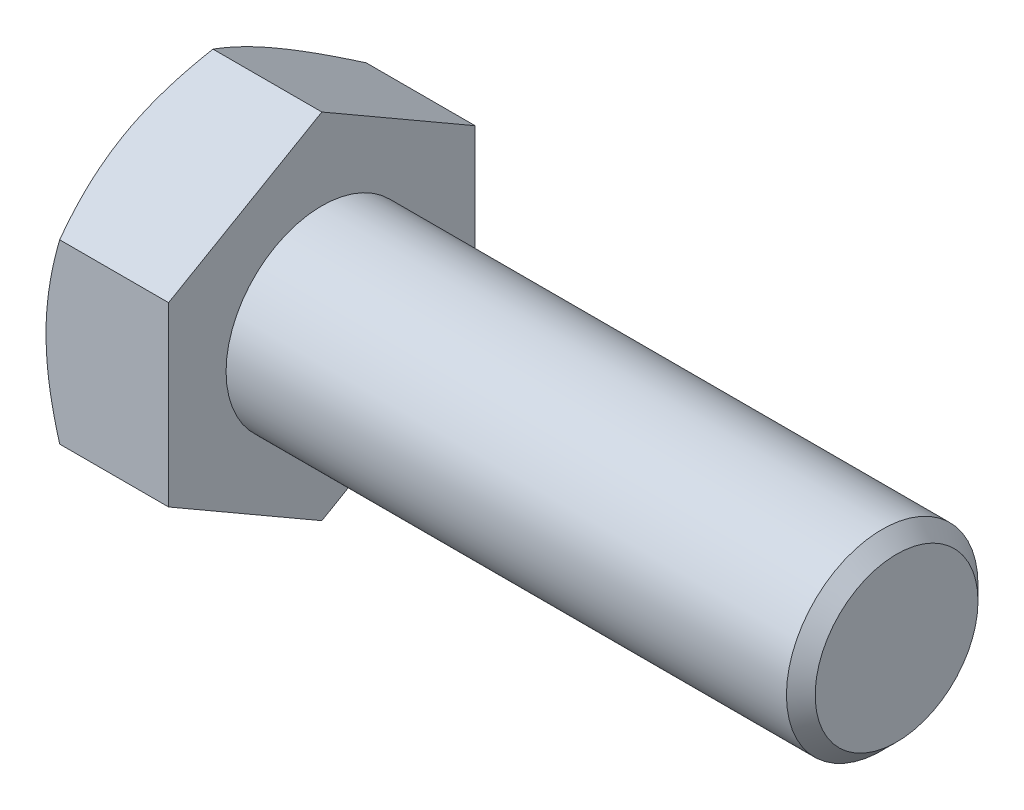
ISO-10303-21;
HEADER;
FILE_DESCRIPTION(('STEP AP214'),'2;1');
FILE_NAME('part.step','',(''),(''),'','','');
FILE_SCHEMA(('AUTOMOTIVE_DESIGN { 1 0 10303 214 1 1 1 1 }'));
ENDSEC;
DATA;
#1=APPLICATION_CONTEXT('core data for automotive mechanical design processes');
#2=APPLICATION_PROTOCOL_DEFINITION('international standard','automotive_design',2000,#1);
#3=PRODUCT_CONTEXT('',#1,'mechanical');
#4=PRODUCT('Part','Part','',(#3));
#5=PRODUCT_RELATED_PRODUCT_CATEGORY('part','',(#4));
#6=PRODUCT_DEFINITION_FORMATION('','',#4);
#7=PRODUCT_DEFINITION_CONTEXT('part definition',#1,'design');
#8=PRODUCT_DEFINITION('design','',#6,#7);
#9=PRODUCT_DEFINITION_SHAPE('','',#8);
#10=(LENGTH_UNIT() NAMED_UNIT(*) SI_UNIT(.MILLI.,.METRE.));
#11=(NAMED_UNIT(*) PLANE_ANGLE_UNIT() SI_UNIT($,.RADIAN.));
#12=(NAMED_UNIT(*) SI_UNIT($,.STERADIAN.) SOLID_ANGLE_UNIT());
#13=UNCERTAINTY_MEASURE_WITH_UNIT(LENGTH_MEASURE(1.E-05),#10,'distance_accuracy_value','');
#14=(GEOMETRIC_REPRESENTATION_CONTEXT(3) GLOBAL_UNCERTAINTY_ASSIGNED_CONTEXT((#13)) GLOBAL_UNIT_ASSIGNED_CONTEXT((#10,
#11,#12)) REPRESENTATION_CONTEXT('',''));
#15=CARTESIAN_POINT('',(0.,0.,0.));
#16=DIRECTION('',(0.,0.,1.));
#17=DIRECTION('',(1.,0.,0.));
#18=AXIS2_PLACEMENT_3D('',#15,#16,#17);
#19=CARTESIAN_POINT('',(30.,0.,0.));
#20=DIRECTION('',(-1.,0.,0.));
#21=DIRECTION('',(0.,0.,1.));
#22=AXIS2_PLACEMENT_3D('',#19,#20,#21);
#23=CYLINDRICAL_SURFACE('',#22,5.);
#24=CARTESIAN_POINT('',(29.25,0.,0.));
#25=DIRECTION('',(1.,0.,0.));
#26=DIRECTION('',(0.,0.,-1.));
#27=AXIS2_PLACEMENT_3D('',#24,#25,#26);
#28=CIRCLE('',#27,5.);
#29=CARTESIAN_POINT('',(29.25,0.,-5.));
#30=VERTEX_POINT('',#29);
#31=EDGE_CURVE('E11',#30,#30,#28,.F.);
#32=ORIENTED_EDGE('',*,*,#31,.T.);
#33=EDGE_LOOP('',(#32));
#34=FACE_BOUND('',#33,.T.);
#35=CARTESIAN_POINT('',(0.,0.,0.));
#36=DIRECTION('',(-1.,0.,0.));
#37=DIRECTION('',(0.,0.,1.));
#38=AXIS2_PLACEMENT_3D('',#35,#36,#37);
#39=CIRCLE('',#38,5.);
#40=CARTESIAN_POINT('',(0.,0.,5.));
#41=VERTEX_POINT('',#40);
#42=EDGE_CURVE('E202',#41,#41,#39,.T.);
#43=ORIENTED_EDGE('',*,*,#42,.F.);
#44=EDGE_LOOP('',(#43));
#45=FACE_BOUND('',#44,.T.);
#46=ADVANCED_FACE('F28',(#34,#45),#23,.T.);
#47=CARTESIAN_POINT('',(30.,0.,0.));
#48=DIRECTION('',(1.,0.,0.));
#49=DIRECTION('',(0.,0.,-1.));
#50=AXIS2_PLACEMENT_3D('',#47,#48,#49);
#51=PLANE('',#50);
#52=CARTESIAN_POINT('',(30.,0.,0.));
#53=DIRECTION('',(1.,0.,0.));
#54=DIRECTION('',(0.,0.,-1.));
#55=AXIS2_PLACEMENT_3D('',#52,#53,#54);
#56=CIRCLE('',#55,4.24999999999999);
#57=CARTESIAN_POINT('',(30.,0.,-4.24999999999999));
#58=VERTEX_POINT('',#57);
#59=EDGE_CURVE('E35',#58,#58,#56,.T.);
#60=ORIENTED_EDGE('',*,*,#59,.T.);
#61=EDGE_LOOP('',(#60));
#62=FACE_BOUND('',#61,.T.);
#63=ADVANCED_FACE('F188',(#62),#51,.T.);
#64=CARTESIAN_POINT('',(0.,-4.61880215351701,8.));
#65=DIRECTION('',(-1.,0.,0.));
#66=DIRECTION('',(0.,0.,1.));
#67=AXIS2_PLACEMENT_3D('',#64,#65,#66);
#68=PLANE('',#67);
#69=DIRECTION('',(0.,0.5,0.866025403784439));
#70=VECTOR('',#69,1.);
#71=CARTESIAN_POINT('',(0.,-9.23760430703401,0.));
#72=LINE('',#71,#70);
#73=CARTESIAN_POINT('',(0.,-9.23760430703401,0.));
#74=VERTEX_POINT('',#73);
#75=CARTESIAN_POINT('',(0.,-4.61880215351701,8.));
#76=VERTEX_POINT('',#75);
#77=EDGE_CURVE('E229',#74,#76,#72,.T.);
#78=ORIENTED_EDGE('',*,*,#77,.F.);
#79=DIRECTION('',(0.,0.5,-0.866025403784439));
#80=VECTOR('',#79,1.);
#81=CARTESIAN_POINT('',(0.,-9.23760430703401,0.));
#82=LINE('',#81,#80);
#83=CARTESIAN_POINT('',(0.,-4.61880215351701,-8.));
#84=VERTEX_POINT('',#83);
#85=EDGE_CURVE('E216',#74,#84,#82,.T.);
#86=ORIENTED_EDGE('',*,*,#85,.T.);
#87=DIRECTION('',(0.,1.,0.));
#88=VECTOR('',#87,1.);
#89=CARTESIAN_POINT('',(0.,-4.61880215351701,-8.));
#90=LINE('',#89,#88);
#91=CARTESIAN_POINT('',(0.,4.618802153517,-8.));
#92=VERTEX_POINT('',#91);
#93=EDGE_CURVE('E219',#84,#92,#90,.T.);
#94=ORIENTED_EDGE('',*,*,#93,.T.);
#95=DIRECTION('',(0.,0.5,0.866025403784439));
#96=VECTOR('',#95,1.);
#97=CARTESIAN_POINT('',(0.,4.618802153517,-8.));
#98=LINE('',#97,#96);
#99=CARTESIAN_POINT('',(0.,9.23760430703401,0.));
#100=VERTEX_POINT('',#99);
#101=EDGE_CURVE('E222',#92,#100,#98,.T.);
#102=ORIENTED_EDGE('',*,*,#101,.T.);
#103=DIRECTION('',(0.,0.5,-0.866025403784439));
#104=VECTOR('',#103,1.);
#105=CARTESIAN_POINT('',(0.,4.618802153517,8.));
#106=LINE('',#105,#104);
#107=CARTESIAN_POINT('',(0.,4.618802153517,8.));
#108=VERTEX_POINT('',#107);
#109=EDGE_CURVE('E225',#108,#100,#106,.T.);
#110=ORIENTED_EDGE('',*,*,#109,.F.);
#111=DIRECTION('',(0.,1.,0.));
#112=VECTOR('',#111,1.);
#113=CARTESIAN_POINT('',(0.,-4.61880215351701,8.));
#114=LINE('',#113,#112);
#115=EDGE_CURVE('E227',#76,#108,#114,.T.);
#116=ORIENTED_EDGE('',*,*,#115,.F.);
#117=EDGE_LOOP('',(#78,#86,#94,#102,#110,#116));
#118=FACE_BOUND('',#117,.T.);
#119=ORIENTED_EDGE('',*,*,#42,.T.);
#120=EDGE_LOOP('',(#119));
#121=FACE_BOUND('',#120,.T.);
#122=ADVANCED_FACE('F159',(#118,#121),#68,.F.);
#123=CARTESIAN_POINT('',(-6.4,-9.23760430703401,0.));
#124=DIRECTION('',(0.,0.866025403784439,-0.5));
#125=DIRECTION('',(0.,0.5,0.866025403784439));
#126=AXIS2_PLACEMENT_3D('',#123,#124,#125);
#127=PLANE('',#126);
#128=CARTESIAN_POINT('',(-5.68540215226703,-9.23771977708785,-0.00020000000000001));
#129=CARTESIAN_POINT('',(-5.7440092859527,-9.13619343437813,0.175648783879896));
#130=CARTESIAN_POINT('',(-5.79995659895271,-9.03428856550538,0.352153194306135));
#131=CARTESIAN_POINT('',(-5.90579899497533,-8.82965122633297,0.70659546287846));
#132=CARTESIAN_POINT('',(-5.95569146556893,-8.72691841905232,0.884533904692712));
#133=CARTESIAN_POINT('',(-6.09530720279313,-8.41707512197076,1.42119823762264));
#134=CARTESIAN_POINT('',(-6.17471882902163,-8.20874154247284,1.78204258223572));
#135=CARTESIAN_POINT('',(-6.26783835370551,-7.89697436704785,2.32203917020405));
#136=CARTESIAN_POINT('',(-6.29436541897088,-7.79447216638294,2.49957818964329));
#137=CARTESIAN_POINT('',(-6.33884682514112,-7.58900421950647,2.8554591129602));
#138=CARTESIAN_POINT('',(-6.35680192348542,-7.4860385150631,3.03380094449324));
#139=CARTESIAN_POINT('',(-6.38368435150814,-7.27992981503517,3.3907916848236));
#140=CARTESIAN_POINT('',(-6.39262192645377,-7.17678715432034,3.5694400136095));
#141=CARTESIAN_POINT('',(-6.40127769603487,-6.97040655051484,3.92690170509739));
#142=CARTESIAN_POINT('',(-6.40099617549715,-6.86716861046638,4.10571506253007));
#143=CARTESIAN_POINT('',(-6.39185497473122,-6.67416139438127,4.44001336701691));
#144=CARTESIAN_POINT('',(-6.38411039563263,-6.58437849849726,4.59552190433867));
#145=CARTESIAN_POINT('',(-6.36179886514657,-6.40502298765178,4.90617476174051));
#146=CARTESIAN_POINT('',(-6.34723145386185,-6.31545038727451,5.06131905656));
#147=CARTESIAN_POINT('',(-6.29363930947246,-6.04707935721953,5.52615131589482));
#148=CARTESIAN_POINT('',(-6.24473135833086,-5.86875596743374,5.83501648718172));
#149=CARTESIAN_POINT('',(-6.12246059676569,-5.51021755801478,6.4560232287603));
#150=CARTESIAN_POINT('',(-6.048579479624,-5.33004829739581,6.76808554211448));
#151=CARTESIAN_POINT('',(-5.88089985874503,-4.97239658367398,7.38755648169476));
#152=CARTESIAN_POINT('',(-5.78714073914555,-4.79490955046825,7.69497304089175));
#153=CARTESIAN_POINT('',(-5.68540215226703,-4.61868668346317,8.0002));
#154=B_SPLINE_CURVE_WITH_KNOTS('',3,(#128,#129,#130,#131,#132,#133,#134,#135,#136,#137,#138,
#139,#140,#141,#142,#143,#144,#145,#146,#147,#148,#149,#150,#151,#152,#153),.UNSPECIFIED.,.F.,
.F.,(4,2,2,2,2,2,2,2,2,2,2,2,4),(0.,0.633973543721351,1.26821965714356,2.53934712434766,
3.15934343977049,3.77928496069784,4.39852133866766,5.01773858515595,5.55680239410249,
6.09590254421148,7.17487077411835,8.27776850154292,9.37850115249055),.UNSPECIFIED.);
#155=CARTESIAN_POINT('',(-5.68546882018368,-9.23760430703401,0.));
#156=VERTEX_POINT('',#155);
#157=CARTESIAN_POINT('',(-6.4,-6.92820323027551,4.));
#158=VERTEX_POINT('',#157);
#159=EDGE_CURVE('E176',#156,#158,#154,.T.);
#160=ORIENTED_EDGE('',*,*,#159,.F.);
#161=DIRECTION('',(1.,0.,0.));
#162=VECTOR('',#161,1.);
#163=CARTESIAN_POINT('',(-6.4,-9.23760430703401,0.));
#164=LINE('',#163,#162);
#165=EDGE_CURVE('E214',#156,#74,#164,.T.);
#166=ORIENTED_EDGE('',*,*,#165,.T.);
#167=ORIENTED_EDGE('',*,*,#77,.T.);
#168=DIRECTION('',(1.,0.,0.));
#169=VECTOR('',#168,1.);
#170=CARTESIAN_POINT('',(-6.4,-4.61880215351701,8.));
#171=LINE('',#170,#169);
#172=CARTESIAN_POINT('',(-5.68546882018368,-4.61880215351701,8.));
#173=VERTEX_POINT('',#172);
#174=EDGE_CURVE('E205',#173,#76,#171,.T.);
#175=ORIENTED_EDGE('',*,*,#174,.F.);
#176=EDGE_CURVE('E130',#158,#173,#154,.T.);
#177=ORIENTED_EDGE('',*,*,#176,.F.);
#178=EDGE_LOOP('',(#160,#166,#167,#175,#177));
#179=FACE_BOUND('',#178,.T.);
#180=ADVANCED_FACE('F182',(#179),#127,.F.);
#181=CARTESIAN_POINT('',(-6.4,-4.61880215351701,8.));
#182=DIRECTION('',(0.,0.,-1.));
#183=DIRECTION('',(-1.,0.,0.));
#184=AXIS2_PLACEMENT_3D('',#181,#182,#183);
#185=PLANE('',#184);
#186=CARTESIAN_POINT('',(-2.40281206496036,-12.5978512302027,8.));
#187=CARTESIAN_POINT('',(-2.57388946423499,-12.246746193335,8.));
#188=CARTESIAN_POINT('',(-2.74338074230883,-11.8948553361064,8.));
#189=CARTESIAN_POINT('',(-3.07830251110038,-11.1890846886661,8.));
#190=CARTESIAN_POINT('',(-3.24373239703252,-10.8352046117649,8.));
#191=CARTESIAN_POINT('',(-3.57043443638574,-10.1233054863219,8.));
#192=CARTESIAN_POINT('',(-3.73168065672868,-9.76527449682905,8.));
#193=CARTESIAN_POINT('',(-4.04782365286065,-9.04643054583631,8.));
#194=CARTESIAN_POINT('',(-4.20272071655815,-8.68561771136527,8.));
#195=CARTESIAN_POINT('',(-4.50960168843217,-7.94836823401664,8.));
#196=CARTESIAN_POINT('',(-4.66130959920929,-7.5718160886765,8.));
#197=CARTESIAN_POINT('',(-4.95369969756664,-6.81437869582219,8.));
#198=CARTESIAN_POINT('',(-5.09438067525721,-6.43349297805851,8.));
#199=CARTESIAN_POINT('',(-5.36116349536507,-5.6674305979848,8.));
#200=CARTESIAN_POINT('',(-5.48729325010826,-5.28226375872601,8.));
#201=CARTESIAN_POINT('',(-5.72105487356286,-4.50642197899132,8.));
#202=CARTESIAN_POINT('',(-5.82869236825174,-4.11574875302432,8.));
#203=CARTESIAN_POINT('',(-6.01985550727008,-3.33076858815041,8.));
#204=CARTESIAN_POINT('',(-6.10351603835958,-2.93649538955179,8.));
#205=CARTESIAN_POINT('',(-6.20749259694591,-2.34134760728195,8.));
#206=CARTESIAN_POINT('',(-6.23856705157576,-2.1423290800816,8.));
#207=CARTESIAN_POINT('',(-6.29294025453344,-1.74323916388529,8.));
#208=CARTESIAN_POINT('',(-6.31623975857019,-1.54316787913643,8.));
#209=CARTESIAN_POINT('',(-6.35429623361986,-1.14493807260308,8.));
#210=CARTESIAN_POINT('',(-6.36916434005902,-0.946790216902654,8.));
#211=CARTESIAN_POINT('',(-6.39050002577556,-0.550042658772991,8.));
#212=CARTESIAN_POINT('',(-6.39696775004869,-0.351442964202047,8.));
#213=CARTESIAN_POINT('',(-6.40134753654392,0.0458536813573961,8.));
#214=CARTESIAN_POINT('',(-6.39925955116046,0.244550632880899,8.));
#215=CARTESIAN_POINT('',(-6.38658102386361,0.641675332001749,8.));
#216=CARTESIAN_POINT('',(-6.37599009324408,0.840103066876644,8.));
#217=CARTESIAN_POINT('',(-6.34097810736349,1.31123186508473,8.));
#218=CARTESIAN_POINT('',(-6.31284309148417,1.58366327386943,8.));
#219=CARTESIAN_POINT('',(-6.24203710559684,2.12661564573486,8.));
#220=CARTESIAN_POINT('',(-6.19936432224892,2.39713636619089,8.));
#221=CARTESIAN_POINT('',(-6.05179305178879,3.20545284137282,8.));
#222=CARTESIAN_POINT('',(-5.92736416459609,3.73973646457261,8.));
#223=CARTESIAN_POINT('',(-5.71012995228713,4.53906436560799,8.));
#224=CARTESIAN_POINT('',(-5.63154182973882,4.80821183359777,8.));
#225=CARTESIAN_POINT('',(-5.46584170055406,5.3438959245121,8.));
#226=CARTESIAN_POINT('',(-5.37872962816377,5.61043252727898,8.));
#227=CARTESIAN_POINT('',(-5.19740915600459,6.14097486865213,8.));
#228=CARTESIAN_POINT('',(-5.10320275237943,6.40498129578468,8.));
#229=CARTESIAN_POINT('',(-4.90883812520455,6.93077992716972,8.));
#230=CARTESIAN_POINT('',(-4.80868003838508,7.19257218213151,8.));
#231=CARTESIAN_POINT('',(-4.53123135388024,7.89757234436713,8.));
#232=CARTESIAN_POINT('',(-4.34922056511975,8.338920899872,8.));
#233=CARTESIAN_POINT('',(-3.97449001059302,9.21706508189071,8.));
#234=CARTESIAN_POINT('',(-3.78176905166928,9.65386019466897,8.));
#235=CARTESIAN_POINT('',(-3.38815487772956,10.5239434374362,8.));
#236=CARTESIAN_POINT('',(-3.18725853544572,10.9572301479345,8.));
#237=CARTESIAN_POINT('',(-2.77925077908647,11.8208356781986,8.));
#238=CARTESIAN_POINT('',(-2.57213961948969,12.2511546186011,8.));
#239=CARTESIAN_POINT('',(-2.15271844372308,13.1101061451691,8.));
#240=CARTESIAN_POINT('',(-1.94040058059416,13.5387348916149,8.));
#241=CARTESIAN_POINT('',(-1.51189757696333,14.3940561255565,8.));
#242=CARTESIAN_POINT('',(-1.29571240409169,14.8207485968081,8.));
#243=CARTESIAN_POINT('',(-0.860283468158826,15.6724483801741,8.));
#244=CARTESIAN_POINT('',(-0.641040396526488,16.0974560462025,8.));
#245=CARTESIAN_POINT('',(-0.200021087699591,16.9461557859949,8.));
#246=CARTESIAN_POINT('',(0.0217551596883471,17.3698478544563,8.));
#247=CARTESIAN_POINT('',(0.642968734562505,18.5495919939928,8.));
#248=CARTESIAN_POINT('',(1.04468640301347,19.3044430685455,8.));
#249=CARTESIAN_POINT('',(1.8529450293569,20.8116128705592,8.));
#250=CARTESIAN_POINT('',(2.25948628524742,21.5639314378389,8.));
#251=CARTESIAN_POINT('',(3.07479055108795,23.064082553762,8.));
#252=CARTESIAN_POINT('',(3.48354147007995,23.8119216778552,8.));
#253=CARTESIAN_POINT('',(4.09870759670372,24.9325210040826,8.));
#254=CARTESIAN_POINT('',(4.30409483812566,25.3058462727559,8.));
#255=CARTESIAN_POINT('',(4.71547851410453,26.0521604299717,8.));
#256=CARTESIAN_POINT('',(4.92147494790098,26.4251493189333,8.));
#257=CARTESIAN_POINT('',(5.12773824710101,26.7979906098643,8.));
#258=B_SPLINE_CURVE_WITH_KNOTS('',3,(#186,#187,#188,#189,#190,#191,#192,#193,#194,#195,#196,
#197,#198,#199,#200,#201,#202,#203,#204,#205,#206,#207,#208,#209,#210,#211,#212,#213,#214,#215,
#216,#217,#218,#219,#220,#221,#222,#223,#224,#225,#226,#227,#228,#229,#230,#231,#232,#233,#234,
#235,#236,#237,#238,#239,#240,#241,#242,#243,#244,#245,#246,#247,#248,#249,#250,#251,#252,#253,
#254,#255,#256,#257),.UNSPECIFIED.,.F.,.F.,(4,2,2,2,2,2,2,2,2,2,2,2,2,2,2,2,2,2,2,2,2,2,2,2,2,2,
2,2,2,2,2,2,2,2,2,4),(0.,1.17171303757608,2.34359951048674,3.52154779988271,4.69944261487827,
5.9172006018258,7.13509201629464,8.35060698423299,9.56575149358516,10.7739194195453,
11.3780811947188,11.982184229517,12.5781274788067,13.174060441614,13.7699967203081,
14.3659602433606,15.1871414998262,16.0084252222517,17.651791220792,18.4928743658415,
19.3339639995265,20.1748178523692,21.0156523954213,22.4476587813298,23.87982501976,
25.312544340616,26.7452050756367,28.1801767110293,29.6151603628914,31.0498246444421,
32.48449470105,35.0497345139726,37.6151336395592,40.1718943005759,41.4501744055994,
42.7284529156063),.UNSPECIFIED.);
#259=CARTESIAN_POINT('',(-6.4,0.,8.));
#260=VERTEX_POINT('',#259);
#261=EDGE_CURVE('E231',#173,#260,#258,.T.);
#262=ORIENTED_EDGE('',*,*,#261,.F.);
#263=ORIENTED_EDGE('',*,*,#174,.T.);
#264=ORIENTED_EDGE('',*,*,#115,.T.);
#265=DIRECTION('',(1.,0.,0.));
#266=VECTOR('',#265,1.);
#267=CARTESIAN_POINT('',(-6.4,4.618802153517,8.));
#268=LINE('',#267,#266);
#269=CARTESIAN_POINT('',(-5.68546882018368,4.618802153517,8.));
#270=VERTEX_POINT('',#269);
#271=EDGE_CURVE('E207',#270,#108,#268,.T.);
#272=ORIENTED_EDGE('',*,*,#271,.F.);
#273=EDGE_CURVE('E101',#260,#270,#258,.T.);
#274=ORIENTED_EDGE('',*,*,#273,.F.);
#275=EDGE_LOOP('',(#262,#263,#264,#272,#274));
#276=FACE_BOUND('',#275,.T.);
#277=ADVANCED_FACE('F185',(#276),#185,.F.);
#278=CARTESIAN_POINT('',(-6.4,4.618802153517,8.));
#279=DIRECTION('',(0.,-0.866025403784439,-0.5));
#280=DIRECTION('',(0.,0.5,-0.866025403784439));
#281=AXIS2_PLACEMENT_3D('',#278,#279,#280);
#282=PLANE('',#281);
#283=CARTESIAN_POINT('',(-5.68540215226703,4.61868668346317,8.0002));
#284=CARTESIAN_POINT('',(-5.7440092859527,4.72021302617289,7.8243512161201));
#285=CARTESIAN_POINT('',(-5.79995659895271,4.82211789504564,7.64784680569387));
#286=CARTESIAN_POINT('',(-5.90579899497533,5.02675523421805,7.29340453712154));
#287=CARTESIAN_POINT('',(-5.95569146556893,5.12948804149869,7.11546609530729));
#288=CARTESIAN_POINT('',(-6.09530720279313,5.43933133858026,6.57880176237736));
#289=CARTESIAN_POINT('',(-6.17471882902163,5.64766491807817,6.21795741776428));
#290=CARTESIAN_POINT('',(-6.26783835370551,5.95943209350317,5.67796082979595));
#291=CARTESIAN_POINT('',(-6.29436541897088,6.06193429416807,5.50042181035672));
#292=CARTESIAN_POINT('',(-6.33884682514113,6.26740224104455,5.1445408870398));
#293=CARTESIAN_POINT('',(-6.35680192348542,6.37036794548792,4.96619905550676));
#294=CARTESIAN_POINT('',(-6.38368435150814,6.57647664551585,4.60920831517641));
#295=CARTESIAN_POINT('',(-6.39262192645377,6.67961930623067,4.4305599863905));
#296=CARTESIAN_POINT('',(-6.40127769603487,6.88599991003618,4.07309829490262));
#297=CARTESIAN_POINT('',(-6.40099617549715,6.98923785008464,3.89428493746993));
#298=CARTESIAN_POINT('',(-6.39185497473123,7.18224506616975,3.5599866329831));
#299=CARTESIAN_POINT('',(-6.38411039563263,7.27202796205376,3.40447809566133));
#300=CARTESIAN_POINT('',(-6.36179886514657,7.45138347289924,3.09382523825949));
#301=CARTESIAN_POINT('',(-6.34723145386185,7.5409560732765,2.93868094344));
#302=CARTESIAN_POINT('',(-6.29363930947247,7.80932710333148,2.47384868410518));
#303=CARTESIAN_POINT('',(-6.24473135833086,7.98765049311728,2.16498351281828));
#304=CARTESIAN_POINT('',(-6.12246059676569,8.34618890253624,1.5439767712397));
#305=CARTESIAN_POINT('',(-6.048579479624,8.52635816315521,1.23191445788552));
#306=CARTESIAN_POINT('',(-5.88089985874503,8.88400987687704,0.612443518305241));
#307=CARTESIAN_POINT('',(-5.78714073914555,9.06149691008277,0.305026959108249));
#308=CARTESIAN_POINT('',(-5.68540215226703,9.23771977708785,-0.000200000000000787));
#309=B_SPLINE_CURVE_WITH_KNOTS('',3,(#283,#284,#285,#286,#287,#288,#289,#290,#291,#292,#293,
#294,#295,#296,#297,#298,#299,#300,#301,#302,#303,#304,#305,#306,#307,#308),.UNSPECIFIED.,.F.,
.F.,(4,2,2,2,2,2,2,2,2,2,2,2,4),(0.,0.633973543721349,1.26821965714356,2.53934712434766,
3.15934343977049,3.77928496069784,4.39852133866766,5.01773858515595,5.55680239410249,
6.09590254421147,7.17487077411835,8.27776850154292,9.37850115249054),.UNSPECIFIED.);
#310=CARTESIAN_POINT('',(-6.4,6.92820323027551,4.));
#311=VERTEX_POINT('',#310);
#312=EDGE_CURVE('E97',#270,#311,#309,.T.);
#313=ORIENTED_EDGE('',*,*,#312,.F.);
#314=ORIENTED_EDGE('',*,*,#271,.T.);
#315=ORIENTED_EDGE('',*,*,#109,.T.);
#316=DIRECTION('',(1.,0.,0.));
#317=VECTOR('',#316,1.);
#318=CARTESIAN_POINT('',(-6.4,9.23760430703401,0.));
#319=LINE('',#318,#317);
#320=CARTESIAN_POINT('',(-5.68546882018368,9.23760430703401,0.));
#321=VERTEX_POINT('',#320);
#322=EDGE_CURVE('E129',#321,#100,#319,.T.);
#323=ORIENTED_EDGE('',*,*,#322,.F.);
#324=EDGE_CURVE('E105',#311,#321,#309,.T.);
#325=ORIENTED_EDGE('',*,*,#324,.F.);
#326=EDGE_LOOP('',(#313,#314,#315,#323,#325));
#327=FACE_BOUND('',#326,.T.);
#328=ADVANCED_FACE('F127',(#327),#282,.F.);
#329=CARTESIAN_POINT('',(-6.4,4.618802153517,-8.));
#330=DIRECTION('',(0.,0.866025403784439,-0.5));
#331=DIRECTION('',(0.,0.5,0.866025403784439));
#332=AXIS2_PLACEMENT_3D('',#329,#330,#331);
#333=PLANE('',#332);
#334=DIRECTION('',(1.,0.,0.));
#335=VECTOR('',#334,1.);
#336=CARTESIAN_POINT('',(-6.4,4.618802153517,-8.));
#337=LINE('',#336,#335);
#338=CARTESIAN_POINT('',(-5.68546882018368,4.618802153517,-8.));
#339=VERTEX_POINT('',#338);
#340=EDGE_CURVE('E210',#339,#92,#337,.T.);
#341=ORIENTED_EDGE('',*,*,#340,.F.);
#342=CARTESIAN_POINT('',(-5.68540215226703,4.61868668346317,-8.0002));
#343=CARTESIAN_POINT('',(-5.7440092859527,4.72021302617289,-7.8243512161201));
#344=CARTESIAN_POINT('',(-5.79995659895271,4.82211789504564,-7.64784680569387));
#345=CARTESIAN_POINT('',(-5.90579899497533,5.02675523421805,-7.29340453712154));
#346=CARTESIAN_POINT('',(-5.95569146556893,5.12948804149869,-7.11546609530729));
#347=CARTESIAN_POINT('',(-6.09530720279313,5.43933133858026,-6.57880176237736));
#348=CARTESIAN_POINT('',(-6.17471882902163,5.64766491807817,-6.21795741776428));
#349=CARTESIAN_POINT('',(-6.26783835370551,5.95943209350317,-5.67796082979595));
#350=CARTESIAN_POINT('',(-6.29436541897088,6.06193429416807,-5.50042181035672));
#351=CARTESIAN_POINT('',(-6.33884682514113,6.26740224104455,-5.1445408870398));
#352=CARTESIAN_POINT('',(-6.35680192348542,6.37036794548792,-4.96619905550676));
#353=CARTESIAN_POINT('',(-6.38368435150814,6.57647664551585,-4.60920831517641));
#354=CARTESIAN_POINT('',(-6.39262192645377,6.67961930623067,-4.4305599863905));
#355=CARTESIAN_POINT('',(-6.40127769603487,6.88599991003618,-4.07309829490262));
#356=CARTESIAN_POINT('',(-6.40099617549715,6.98923785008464,-3.89428493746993));
#357=CARTESIAN_POINT('',(-6.39185497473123,7.18224506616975,-3.5599866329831));
#358=CARTESIAN_POINT('',(-6.38411039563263,7.27202796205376,-3.40447809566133));
#359=CARTESIAN_POINT('',(-6.36179886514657,7.45138347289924,-3.09382523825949));
#360=CARTESIAN_POINT('',(-6.34723145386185,7.5409560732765,-2.93868094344));
#361=CARTESIAN_POINT('',(-6.29363930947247,7.80932710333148,-2.47384868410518));
#362=CARTESIAN_POINT('',(-6.24473135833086,7.98765049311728,-2.16498351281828));
#363=CARTESIAN_POINT('',(-6.12246059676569,8.34618890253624,-1.5439767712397));
#364=CARTESIAN_POINT('',(-6.048579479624,8.52635816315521,-1.23191445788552));
#365=CARTESIAN_POINT('',(-5.88089985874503,8.88400987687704,-0.612443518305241));
#366=CARTESIAN_POINT('',(-5.78714073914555,9.06149691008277,-0.305026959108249));
#367=CARTESIAN_POINT('',(-5.68540215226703,9.23771977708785,0.000200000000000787));
#368=B_SPLINE_CURVE_WITH_KNOTS('',3,(#342,#343,#344,#345,#346,#347,#348,#349,#350,#351,#352,
#353,#354,#355,#356,#357,#358,#359,#360,#361,#362,#363,#364,#365,#366,#367),.UNSPECIFIED.,.F.,
.F.,(4,2,2,2,2,2,2,2,2,2,2,2,4),(0.,0.633973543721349,1.26821965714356,2.53934712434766,
3.15934343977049,3.77928496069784,4.39852133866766,5.01773858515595,5.55680239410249,
6.09590254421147,7.17487077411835,8.27776850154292,9.37850115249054),.UNSPECIFIED.);
#369=CARTESIAN_POINT('',(-6.4,6.92820323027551,-4.));
#370=VERTEX_POINT('',#369);
#371=EDGE_CURVE('E132',#339,#370,#368,.T.);
#372=ORIENTED_EDGE('',*,*,#371,.T.);
#373=EDGE_CURVE('E112',#370,#321,#368,.T.);
#374=ORIENTED_EDGE('',*,*,#373,.T.);
#375=ORIENTED_EDGE('',*,*,#322,.T.);
#376=ORIENTED_EDGE('',*,*,#101,.F.);
#377=EDGE_LOOP('',(#341,#372,#374,#375,#376));
#378=FACE_BOUND('',#377,.T.);
#379=ADVANCED_FACE('F257',(#378),#333,.T.);
#380=CARTESIAN_POINT('',(-6.4,-4.61880215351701,-8.));
#381=DIRECTION('',(0.,0.,-1.));
#382=DIRECTION('',(-1.,0.,0.));
#383=AXIS2_PLACEMENT_3D('',#380,#381,#382);
#384=PLANE('',#383);
#385=DIRECTION('',(1.,0.,0.));
#386=VECTOR('',#385,1.);
#387=CARTESIAN_POINT('',(-6.4,-4.61880215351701,-8.));
#388=LINE('',#387,#386);
#389=CARTESIAN_POINT('',(-5.68546882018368,-4.61880215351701,-8.));
#390=VERTEX_POINT('',#389);
#391=EDGE_CURVE('E212',#390,#84,#388,.T.);
#392=ORIENTED_EDGE('',*,*,#391,.F.);
#393=CARTESIAN_POINT('',(-2.40281206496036,-12.5978512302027,-8.));
#394=CARTESIAN_POINT('',(-2.57388946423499,-12.246746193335,-8.));
#395=CARTESIAN_POINT('',(-2.74338074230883,-11.8948553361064,-8.));
#396=CARTESIAN_POINT('',(-3.07830251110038,-11.1890846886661,-8.));
#397=CARTESIAN_POINT('',(-3.24373239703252,-10.8352046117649,-8.));
#398=CARTESIAN_POINT('',(-3.57043443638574,-10.1233054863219,-8.));
#399=CARTESIAN_POINT('',(-3.73168065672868,-9.76527449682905,-8.));
#400=CARTESIAN_POINT('',(-4.04782365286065,-9.04643054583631,-8.));
#401=CARTESIAN_POINT('',(-4.20272071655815,-8.68561771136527,-8.));
#402=CARTESIAN_POINT('',(-4.50960168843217,-7.94836823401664,-8.));
#403=CARTESIAN_POINT('',(-4.66130959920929,-7.5718160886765,-8.));
#404=CARTESIAN_POINT('',(-4.95369969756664,-6.81437869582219,-8.));
#405=CARTESIAN_POINT('',(-5.09438067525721,-6.43349297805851,-8.));
#406=CARTESIAN_POINT('',(-5.36116349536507,-5.6674305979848,-8.));
#407=CARTESIAN_POINT('',(-5.48729325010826,-5.28226375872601,-8.));
#408=CARTESIAN_POINT('',(-5.72105487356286,-4.50642197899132,-8.));
#409=CARTESIAN_POINT('',(-5.82869236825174,-4.11574875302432,-8.));
#410=CARTESIAN_POINT('',(-6.01985550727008,-3.33076858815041,-8.));
#411=CARTESIAN_POINT('',(-6.10351603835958,-2.93649538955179,-8.));
#412=CARTESIAN_POINT('',(-6.20749259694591,-2.34134760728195,-8.));
#413=CARTESIAN_POINT('',(-6.23856705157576,-2.1423290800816,-8.));
#414=CARTESIAN_POINT('',(-6.29294025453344,-1.74323916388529,-8.));
#415=CARTESIAN_POINT('',(-6.31623975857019,-1.54316787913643,-8.));
#416=CARTESIAN_POINT('',(-6.35429623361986,-1.14493807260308,-8.));
#417=CARTESIAN_POINT('',(-6.36916434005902,-0.946790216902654,-8.));
#418=CARTESIAN_POINT('',(-6.39050002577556,-0.550042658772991,-8.));
#419=CARTESIAN_POINT('',(-6.39696775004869,-0.351442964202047,-8.));
#420=CARTESIAN_POINT('',(-6.40134753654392,0.0458536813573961,-8.));
#421=CARTESIAN_POINT('',(-6.39925955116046,0.244550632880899,-8.));
#422=CARTESIAN_POINT('',(-6.38658102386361,0.641675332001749,-8.));
#423=CARTESIAN_POINT('',(-6.37599009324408,0.840103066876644,-8.));
#424=CARTESIAN_POINT('',(-6.34097810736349,1.31123186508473,-8.));
#425=CARTESIAN_POINT('',(-6.31284309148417,1.58366327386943,-8.));
#426=CARTESIAN_POINT('',(-6.24203710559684,2.12661564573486,-8.));
#427=CARTESIAN_POINT('',(-6.19936432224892,2.39713636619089,-8.));
#428=CARTESIAN_POINT('',(-6.05179305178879,3.20545284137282,-8.));
#429=CARTESIAN_POINT('',(-5.92736416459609,3.73973646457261,-8.));
#430=CARTESIAN_POINT('',(-5.71012995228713,4.53906436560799,-8.));
#431=CARTESIAN_POINT('',(-5.63154182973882,4.80821183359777,-8.));
#432=CARTESIAN_POINT('',(-5.46584170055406,5.3438959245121,-8.));
#433=CARTESIAN_POINT('',(-5.37872962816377,5.61043252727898,-8.));
#434=CARTESIAN_POINT('',(-5.19740915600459,6.14097486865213,-8.));
#435=CARTESIAN_POINT('',(-5.10320275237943,6.40498129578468,-8.));
#436=CARTESIAN_POINT('',(-4.90883812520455,6.93077992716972,-8.));
#437=CARTESIAN_POINT('',(-4.80868003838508,7.19257218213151,-8.));
#438=CARTESIAN_POINT('',(-4.53123135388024,7.89757234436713,-8.));
#439=CARTESIAN_POINT('',(-4.34922056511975,8.338920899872,-8.));
#440=CARTESIAN_POINT('',(-3.97449001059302,9.21706508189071,-8.));
#441=CARTESIAN_POINT('',(-3.78176905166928,9.65386019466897,-8.));
#442=CARTESIAN_POINT('',(-3.38815487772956,10.5239434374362,-8.));
#443=CARTESIAN_POINT('',(-3.18725853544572,10.9572301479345,-8.));
#444=CARTESIAN_POINT('',(-2.77925077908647,11.8208356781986,-8.));
#445=CARTESIAN_POINT('',(-2.57213961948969,12.2511546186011,-8.));
#446=CARTESIAN_POINT('',(-2.15271844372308,13.1101061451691,-8.));
#447=CARTESIAN_POINT('',(-1.94040058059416,13.5387348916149,-8.));
#448=CARTESIAN_POINT('',(-1.51189757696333,14.3940561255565,-8.));
#449=CARTESIAN_POINT('',(-1.29571240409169,14.8207485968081,-8.));
#450=CARTESIAN_POINT('',(-0.860283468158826,15.6724483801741,-8.));
#451=CARTESIAN_POINT('',(-0.641040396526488,16.0974560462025,-8.));
#452=CARTESIAN_POINT('',(-0.200021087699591,16.9461557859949,-8.));
#453=CARTESIAN_POINT('',(0.0217551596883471,17.3698478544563,-8.));
#454=CARTESIAN_POINT('',(0.642968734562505,18.5495919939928,-8.));
#455=CARTESIAN_POINT('',(1.04468640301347,19.3044430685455,-8.));
#456=CARTESIAN_POINT('',(1.8529450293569,20.8116128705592,-8.));
#457=CARTESIAN_POINT('',(2.25948628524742,21.5639314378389,-8.));
#458=CARTESIAN_POINT('',(3.07479055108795,23.064082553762,-8.));
#459=CARTESIAN_POINT('',(3.48354147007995,23.8119216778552,-8.));
#460=CARTESIAN_POINT('',(4.09870759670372,24.9325210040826,-8.));
#461=CARTESIAN_POINT('',(4.30409483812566,25.3058462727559,-8.));
#462=CARTESIAN_POINT('',(4.71547851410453,26.0521604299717,-8.));
#463=CARTESIAN_POINT('',(4.92147494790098,26.4251493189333,-8.));
#464=CARTESIAN_POINT('',(5.12773824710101,26.7979906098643,-8.));
#465=B_SPLINE_CURVE_WITH_KNOTS('',3,(#393,#394,#395,#396,#397,#398,#399,#400,#401,#402,#403,
#404,#405,#406,#407,#408,#409,#410,#411,#412,#413,#414,#415,#416,#417,#418,#419,#420,#421,#422,
#423,#424,#425,#426,#427,#428,#429,#430,#431,#432,#433,#434,#435,#436,#437,#438,#439,#440,#441,
#442,#443,#444,#445,#446,#447,#448,#449,#450,#451,#452,#453,#454,#455,#456,#457,#458,#459,#460,
#461,#462,#463,#464),.UNSPECIFIED.,.F.,.F.,(4,2,2,2,2,2,2,2,2,2,2,2,2,2,2,2,2,2,2,2,2,2,2,2,2,2,
2,2,2,2,2,2,2,2,2,4),(0.,1.17171303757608,2.34359951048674,3.52154779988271,4.69944261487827,
5.9172006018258,7.13509201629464,8.35060698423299,9.56575149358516,10.7739194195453,
11.3780811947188,11.982184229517,12.5781274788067,13.174060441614,13.7699967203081,
14.3659602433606,15.1871414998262,16.0084252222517,17.651791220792,18.4928743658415,
19.3339639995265,20.1748178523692,21.0156523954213,22.4476587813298,23.87982501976,
25.312544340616,26.7452050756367,28.1801767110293,29.6151603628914,31.0498246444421,
32.48449470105,35.0497345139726,37.6151336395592,40.1718943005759,41.4501744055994,
42.7284529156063),.UNSPECIFIED.);
#466=CARTESIAN_POINT('',(-6.4,0.,-8.));
#467=VERTEX_POINT('',#466);
#468=EDGE_CURVE('E50',#390,#467,#465,.T.);
#469=ORIENTED_EDGE('',*,*,#468,.T.);
#470=EDGE_CURVE('E181',#467,#339,#465,.T.);
#471=ORIENTED_EDGE('',*,*,#470,.T.);
#472=ORIENTED_EDGE('',*,*,#340,.T.);
#473=ORIENTED_EDGE('',*,*,#93,.F.);
#474=EDGE_LOOP('',(#392,#469,#471,#472,#473));
#475=FACE_BOUND('',#474,.T.);
#476=ADVANCED_FACE('F253',(#475),#384,.T.);
#477=CARTESIAN_POINT('',(-6.4,-9.23760430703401,0.));
#478=DIRECTION('',(0.,-0.866025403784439,-0.5));
#479=DIRECTION('',(0.,0.5,-0.866025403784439));
#480=AXIS2_PLACEMENT_3D('',#477,#478,#479);
#481=PLANE('',#480);
#482=ORIENTED_EDGE('',*,*,#165,.F.);
#483=CARTESIAN_POINT('',(-5.68540215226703,-9.23771977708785,0.00020000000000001));
#484=CARTESIAN_POINT('',(-5.7440092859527,-9.13619343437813,-0.175648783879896));
#485=CARTESIAN_POINT('',(-5.79995659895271,-9.03428856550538,-0.352153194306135));
#486=CARTESIAN_POINT('',(-5.90579899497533,-8.82965122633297,-0.70659546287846));
#487=CARTESIAN_POINT('',(-5.95569146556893,-8.72691841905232,-0.884533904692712));
#488=CARTESIAN_POINT('',(-6.09530720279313,-8.41707512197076,-1.42119823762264));
#489=CARTESIAN_POINT('',(-6.17471882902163,-8.20874154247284,-1.78204258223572));
#490=CARTESIAN_POINT('',(-6.26783835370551,-7.89697436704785,-2.32203917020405));
#491=CARTESIAN_POINT('',(-6.29436541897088,-7.79447216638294,-2.49957818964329));
#492=CARTESIAN_POINT('',(-6.33884682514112,-7.58900421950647,-2.8554591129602));
#493=CARTESIAN_POINT('',(-6.35680192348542,-7.4860385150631,-3.03380094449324));
#494=CARTESIAN_POINT('',(-6.38368435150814,-7.27992981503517,-3.3907916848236));
#495=CARTESIAN_POINT('',(-6.39262192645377,-7.17678715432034,-3.5694400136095));
#496=CARTESIAN_POINT('',(-6.40127769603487,-6.97040655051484,-3.92690170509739));
#497=CARTESIAN_POINT('',(-6.40099617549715,-6.86716861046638,-4.10571506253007));
#498=CARTESIAN_POINT('',(-6.39185497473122,-6.67416139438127,-4.44001336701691));
#499=CARTESIAN_POINT('',(-6.38411039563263,-6.58437849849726,-4.59552190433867));
#500=CARTESIAN_POINT('',(-6.36179886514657,-6.40502298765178,-4.90617476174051));
#501=CARTESIAN_POINT('',(-6.34723145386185,-6.31545038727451,-5.06131905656));
#502=CARTESIAN_POINT('',(-6.29363930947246,-6.04707935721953,-5.52615131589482));
#503=CARTESIAN_POINT('',(-6.24473135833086,-5.86875596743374,-5.83501648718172));
#504=CARTESIAN_POINT('',(-6.12246059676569,-5.51021755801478,-6.4560232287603));
#505=CARTESIAN_POINT('',(-6.048579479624,-5.33004829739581,-6.76808554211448));
#506=CARTESIAN_POINT('',(-5.88089985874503,-4.97239658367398,-7.38755648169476));
#507=CARTESIAN_POINT('',(-5.78714073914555,-4.79490955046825,-7.69497304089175));
#508=CARTESIAN_POINT('',(-5.68540215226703,-4.61868668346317,-8.0002));
#509=B_SPLINE_CURVE_WITH_KNOTS('',3,(#483,#484,#485,#486,#487,#488,#489,#490,#491,#492,#493,
#494,#495,#496,#497,#498,#499,#500,#501,#502,#503,#504,#505,#506,#507,#508),.UNSPECIFIED.,.F.,
.F.,(4,2,2,2,2,2,2,2,2,2,2,2,4),(0.,0.633973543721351,1.26821965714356,2.53934712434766,
3.15934343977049,3.77928496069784,4.39852133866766,5.01773858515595,5.55680239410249,
6.09590254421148,7.17487077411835,8.27776850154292,9.37850115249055),.UNSPECIFIED.);
#510=CARTESIAN_POINT('',(-6.4,-6.92820323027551,-4.));
#511=VERTEX_POINT('',#510);
#512=EDGE_CURVE('E245',#156,#511,#509,.T.);
#513=ORIENTED_EDGE('',*,*,#512,.T.);
#514=EDGE_CURVE('E124',#511,#390,#509,.T.);
#515=ORIENTED_EDGE('',*,*,#514,.T.);
#516=ORIENTED_EDGE('',*,*,#391,.T.);
#517=ORIENTED_EDGE('',*,*,#85,.F.);
#518=EDGE_LOOP('',(#482,#513,#515,#516,#517));
#519=FACE_BOUND('',#518,.T.);
#520=ADVANCED_FACE('F249',(#519),#481,.T.);
#521=CARTESIAN_POINT('',(-6.4,0.,0.));
#522=DIRECTION('',(1.,0.,0.));
#523=DIRECTION('',(0.,0.,1.));
#524=AXIS2_PLACEMENT_3D('',#521,#522,#523);
#525=CONICAL_SURFACE('',#524,8.,1.0471975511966);
#526=ORIENTED_EDGE('',*,*,#176,.T.);
#527=ORIENTED_EDGE('',*,*,#261,.T.);
#528=CARTESIAN_POINT('',(-6.4,0.,0.));
#529=DIRECTION('',(-1.,0.,0.));
#530=DIRECTION('',(0.,0.,1.));
#531=AXIS2_PLACEMENT_3D('',#528,#529,#530);
#532=CIRCLE('',#531,8.);
#533=EDGE_CURVE('E119',#158,#260,#532,.T.);
#534=ORIENTED_EDGE('',*,*,#533,.F.);
#535=EDGE_LOOP('',(#526,#527,#534));
#536=FACE_BOUND('',#535,.T.);
#537=ADVANCED_FACE('F157',(#536),#525,.T.);
#538=ORIENTED_EDGE('',*,*,#512,.F.);
#539=ORIENTED_EDGE('',*,*,#159,.T.);
#540=EDGE_CURVE('E201',#511,#158,#532,.T.);
#541=ORIENTED_EDGE('',*,*,#540,.F.);
#542=EDGE_LOOP('',(#538,#539,#541));
#543=FACE_BOUND('',#542,.T.);
#544=ADVANCED_FACE('F156',(#543),#525,.T.);
#545=ORIENTED_EDGE('',*,*,#468,.F.);
#546=ORIENTED_EDGE('',*,*,#514,.F.);
#547=EDGE_CURVE('E288',#467,#511,#532,.T.);
#548=ORIENTED_EDGE('',*,*,#547,.F.);
#549=EDGE_LOOP('',(#545,#546,#548));
#550=FACE_BOUND('',#549,.T.);
#551=ADVANCED_FACE('F150',(#550),#525,.T.);
#552=ORIENTED_EDGE('',*,*,#371,.F.);
#553=ORIENTED_EDGE('',*,*,#470,.F.);
#554=EDGE_CURVE('E117',#370,#467,#532,.T.);
#555=ORIENTED_EDGE('',*,*,#554,.F.);
#556=EDGE_LOOP('',(#552,#553,#555));
#557=FACE_BOUND('',#556,.T.);
#558=ADVANCED_FACE('F155',(#557),#525,.T.);
#559=EDGE_CURVE('E109',#311,#370,#532,.T.);
#560=ORIENTED_EDGE('',*,*,#559,.F.);
#561=ORIENTED_EDGE('',*,*,#324,.T.);
#562=ORIENTED_EDGE('',*,*,#373,.F.);
#563=EDGE_LOOP('',(#560,#561,#562));
#564=FACE_BOUND('',#563,.T.);
#565=ADVANCED_FACE('F110',(#564),#525,.T.);
#566=CARTESIAN_POINT('',(-6.4,0.,0.));
#567=DIRECTION('',(-1.,0.,0.));
#568=DIRECTION('',(0.,0.,1.));
#569=AXIS2_PLACEMENT_3D('',#566,#567,#568);
#570=CIRCLE('',#569,8.);
#571=EDGE_CURVE('E42',#260,#311,#570,.T.);
#572=ORIENTED_EDGE('',*,*,#571,.F.);
#573=ORIENTED_EDGE('',*,*,#273,.T.);
#574=ORIENTED_EDGE('',*,*,#312,.T.);
#575=EDGE_LOOP('',(#572,#573,#574));
#576=FACE_BOUND('',#575,.T.);
#577=ADVANCED_FACE('F99',(#576),#525,.T.);
#578=CARTESIAN_POINT('',(-6.4,-4.61880215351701,8.));
#579=DIRECTION('',(-1.,0.,0.));
#580=DIRECTION('',(0.,0.,1.));
#581=AXIS2_PLACEMENT_3D('',#578,#579,#580);
#582=PLANE('',#581);
#583=ORIENTED_EDGE('',*,*,#533,.T.);
#584=ORIENTED_EDGE('',*,*,#571,.T.);
#585=ORIENTED_EDGE('',*,*,#559,.T.);
#586=ORIENTED_EDGE('',*,*,#554,.T.);
#587=ORIENTED_EDGE('',*,*,#547,.T.);
#588=ORIENTED_EDGE('',*,*,#540,.T.);
#589=EDGE_LOOP('',(#583,#584,#585,#586,#587,#588));
#590=FACE_BOUND('',#589,.T.);
#591=ADVANCED_FACE('F121',(#590),#582,.T.);
#592=CARTESIAN_POINT('',(30.,0.,0.));
#593=DIRECTION('',(-1.,0.,0.));
#594=DIRECTION('',(0.,0.,1.));
#595=AXIS2_PLACEMENT_3D('',#592,#593,#594);
#596=CONICAL_SURFACE('',#595,4.24999999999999,0.785398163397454);
#597=ORIENTED_EDGE('',*,*,#31,.F.);
#598=EDGE_LOOP('',(#597));
#599=FACE_BOUND('',#598,.T.);
#600=ORIENTED_EDGE('',*,*,#59,.F.);
#601=EDGE_LOOP('',(#600));
#602=FACE_BOUND('',#601,.T.);
#603=ADVANCED_FACE('F158',(#599,#602),#596,.T.);
#604=CLOSED_SHELL('',(#46,#63,#122,#180,#277,#328,#379,#476,#520,#537,#544,#551,#558,#565,#577,
#591,#603));
#605=MANIFOLD_SOLID_BREP('B2',#604);
#606=ADVANCED_BREP_SHAPE_REPRESENTATION('',(#18,#605),#14);
#607=SHAPE_DEFINITION_REPRESENTATION(#9,#606);
ENDSEC;
END-ISO-10303-21;
